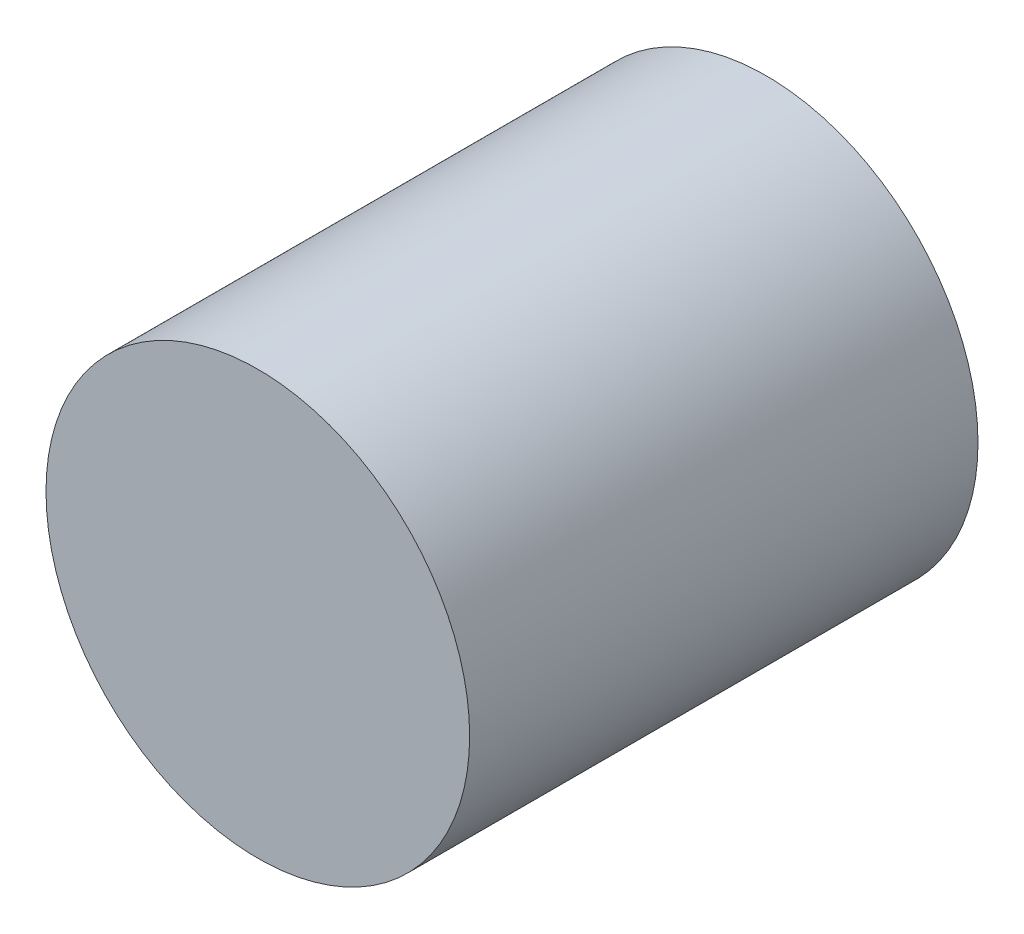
ISO-10303-21;
HEADER;
FILE_DESCRIPTION(('STEP AP214'),'2;1');
FILE_NAME('part.step','',(''),(''),'','','');
FILE_SCHEMA(('AUTOMOTIVE_DESIGN { 1 0 10303 214 1 1 1 1 }'));
ENDSEC;
DATA;
#1=APPLICATION_CONTEXT('core data for automotive mechanical design processes');
#2=APPLICATION_PROTOCOL_DEFINITION('international standard','automotive_design',2000,#1);
#3=PRODUCT_CONTEXT('',#1,'mechanical');
#4=PRODUCT('Part','Part','',(#3));
#5=PRODUCT_RELATED_PRODUCT_CATEGORY('part','',(#4));
#6=PRODUCT_DEFINITION_FORMATION('','',#4);
#7=PRODUCT_DEFINITION_CONTEXT('part definition',#1,'design');
#8=PRODUCT_DEFINITION('design','',#6,#7);
#9=PRODUCT_DEFINITION_SHAPE('','',#8);
#10=(LENGTH_UNIT() NAMED_UNIT(*) SI_UNIT(.MILLI.,.METRE.));
#11=(NAMED_UNIT(*) PLANE_ANGLE_UNIT() SI_UNIT($,.RADIAN.));
#12=(NAMED_UNIT(*) SI_UNIT($,.STERADIAN.) SOLID_ANGLE_UNIT());
#13=UNCERTAINTY_MEASURE_WITH_UNIT(LENGTH_MEASURE(1.E-05),#10,'distance_accuracy_value','');
#14=(GEOMETRIC_REPRESENTATION_CONTEXT(3) GLOBAL_UNCERTAINTY_ASSIGNED_CONTEXT((#13)) GLOBAL_UNIT_ASSIGNED_CONTEXT((#10,
#11,#12)) REPRESENTATION_CONTEXT('',''));
#15=CARTESIAN_POINT('',(0.,0.,0.));
#16=DIRECTION('',(0.,0.,1.));
#17=DIRECTION('',(1.,0.,0.));
#18=AXIS2_PLACEMENT_3D('',#15,#16,#17);
#19=CARTESIAN_POINT('',(0.,0.,15.));
#20=DIRECTION('',(0.,0.,-1.));
#21=DIRECTION('',(-1.,0.,0.));
#22=AXIS2_PLACEMENT_3D('',#19,#20,#21);
#23=CYLINDRICAL_SURFACE('',#22,12.5);
#24=CARTESIAN_POINT('',(0.,0.,15.));
#25=DIRECTION('',(0.,0.,1.));
#26=DIRECTION('',(1.,0.,0.));
#27=AXIS2_PLACEMENT_3D('',#24,#25,#26);
#28=CIRCLE('',#27,12.5);
#29=CARTESIAN_POINT('',(12.5,0.,15.));
#30=VERTEX_POINT('',#29);
#31=EDGE_CURVE('E10',#30,#30,#28,.T.);
#32=ORIENTED_EDGE('',*,*,#31,.F.);
#33=EDGE_LOOP('',(#32));
#34=FACE_BOUND('',#33,.T.);
#35=CARTESIAN_POINT('',(0.,0.,-15.));
#36=DIRECTION('',(0.,0.,1.));
#37=DIRECTION('',(1.,0.,0.));
#38=AXIS2_PLACEMENT_3D('',#35,#36,#37);
#39=CIRCLE('',#38,12.5);
#40=CARTESIAN_POINT('',(12.5,0.,-15.));
#41=VERTEX_POINT('',#40);
#42=EDGE_CURVE('E36',#41,#41,#39,.T.);
#43=ORIENTED_EDGE('',*,*,#42,.T.);
#44=EDGE_LOOP('',(#43));
#45=FACE_BOUND('',#44,.T.);
#46=ADVANCED_FACE('F33',(#34,#45),#23,.T.);
#47=CARTESIAN_POINT('',(0.,0.,15.));
#48=DIRECTION('',(0.,0.,1.));
#49=DIRECTION('',(1.,0.,0.));
#50=AXIS2_PLACEMENT_3D('',#47,#48,#49);
#51=PLANE('',#50);
#52=ORIENTED_EDGE('',*,*,#31,.T.);
#53=EDGE_LOOP('',(#52));
#54=FACE_BOUND('',#53,.T.);
#55=ADVANCED_FACE('F48',(#54),#51,.T.);
#56=CARTESIAN_POINT('',(0.,0.,-15.));
#57=DIRECTION('',(0.,0.,1.));
#58=DIRECTION('',(1.,0.,0.));
#59=AXIS2_PLACEMENT_3D('',#56,#57,#58);
#60=PLANE('',#59);
#61=ORIENTED_EDGE('',*,*,#42,.F.);
#62=EDGE_LOOP('',(#61));
#63=FACE_BOUND('',#62,.T.);
#64=ADVANCED_FACE('F46',(#63),#60,.F.);
#65=CLOSED_SHELL('',(#46,#55,#64));
#66=MANIFOLD_SOLID_BREP('B2',#65);
#67=ADVANCED_BREP_SHAPE_REPRESENTATION('',(#18,#66),#14);
#68=SHAPE_DEFINITION_REPRESENTATION(#9,#67);
ENDSEC;
END-ISO-10303-21;
